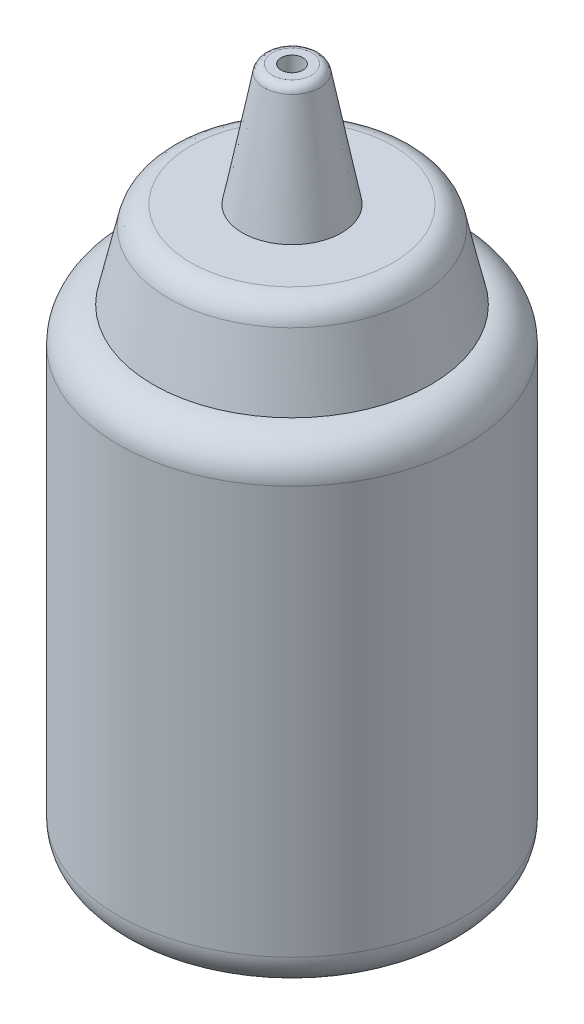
ISO-10303-21;
HEADER;
FILE_DESCRIPTION(('STEP AP214'),'2;1');
FILE_NAME('part.step','',(''),(''),'','','');
FILE_SCHEMA(('AUTOMOTIVE_DESIGN { 1 0 10303 214 1 1 1 1 }'));
ENDSEC;
DATA;
#1=APPLICATION_CONTEXT('core data for automotive mechanical design processes');
#2=APPLICATION_PROTOCOL_DEFINITION('international standard','automotive_design',2000,#1);
#3=PRODUCT_CONTEXT('',#1,'mechanical');
#4=PRODUCT('Part','Part','',(#3));
#5=PRODUCT_RELATED_PRODUCT_CATEGORY('part','',(#4));
#6=PRODUCT_DEFINITION_FORMATION('','',#4);
#7=PRODUCT_DEFINITION_CONTEXT('part definition',#1,'design');
#8=PRODUCT_DEFINITION('design','',#6,#7);
#9=PRODUCT_DEFINITION_SHAPE('','',#8);
#10=(LENGTH_UNIT() NAMED_UNIT(*) SI_UNIT(.MILLI.,.METRE.));
#11=(NAMED_UNIT(*) PLANE_ANGLE_UNIT() SI_UNIT($,.RADIAN.));
#12=(NAMED_UNIT(*) SI_UNIT($,.STERADIAN.) SOLID_ANGLE_UNIT());
#13=UNCERTAINTY_MEASURE_WITH_UNIT(LENGTH_MEASURE(1.E-05),#10,'distance_accuracy_value','');
#14=(GEOMETRIC_REPRESENTATION_CONTEXT(3) GLOBAL_UNCERTAINTY_ASSIGNED_CONTEXT((#13)) GLOBAL_UNIT_ASSIGNED_CONTEXT((#10,
#11,#12)) REPRESENTATION_CONTEXT('',''));
#15=CARTESIAN_POINT('',(0.,0.,0.));
#16=DIRECTION('',(0.,0.,1.));
#17=DIRECTION('',(1.,0.,0.));
#18=AXIS2_PLACEMENT_3D('',#15,#16,#17);
#19=CARTESIAN_POINT('',(-16.0001000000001,55.,0.));
#20=CARTESIAN_POINT('',(-18.2001000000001,55.,0.));
#21=CARTESIAN_POINT('',(-20.,53.2001,0.));
#22=CARTESIAN_POINT('',(-20.,51.0001,0.));
#23=B_SPLINE_CURVE_WITH_KNOTS('',3,(#19,#20,#21,#22),.UNSPECIFIED.,.F.,.F.,(4,4),(0.,
0.0909090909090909),.UNSPECIFIED.);
#24=CARTESIAN_POINT('',(0.,0.,0.));
#25=DIRECTION('',(0.,-1.,0.));
#26=AXIS1_PLACEMENT('',#24,#25);
#27=SURFACE_OF_REVOLUTION('',#23,#26);
#28=CARTESIAN_POINT('',(0.,51.0001,0.));
#29=DIRECTION('',(0.,-1.,0.));
#30=DIRECTION('',(0.,0.,-1.));
#31=AXIS2_PLACEMENT_3D('',#28,#29,#30);
#32=CIRCLE('',#31,20.);
#33=CARTESIAN_POINT('',(0.,51.0001,-20.));
#34=VERTEX_POINT('',#33);
#35=EDGE_CURVE('E79',#34,#34,#32,.T.);
#36=ORIENTED_EDGE('',*,*,#35,.F.);
#37=EDGE_LOOP('',(#36));
#38=FACE_BOUND('',#37,.T.);
#39=CARTESIAN_POINT('',(0.,55.,0.));
#40=DIRECTION('',(0.,-1.,0.));
#41=DIRECTION('',(0.,0.,-1.));
#42=AXIS2_PLACEMENT_3D('',#39,#40,#41);
#43=CIRCLE('',#42,16.0001000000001);
#44=CARTESIAN_POINT('',(0.,55.,-16.0001000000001));
#45=VERTEX_POINT('',#44);
#46=EDGE_CURVE('E10',#45,#45,#43,.T.);
#47=ORIENTED_EDGE('',*,*,#46,.T.);
#48=EDGE_LOOP('',(#47));
#49=FACE_BOUND('',#48,.T.);
#50=ADVANCED_FACE('F39',(#38,#49),#27,.T.);
#51=CARTESIAN_POINT('',(0.,62.7408,0.));
#52=DIRECTION('',(0.,-1.,0.));
#53=DIRECTION('',(0.,0.,-1.));
#54=AXIS2_PLACEMENT_3D('',#51,#52,#53);
#55=CONICAL_SURFACE('',#54,14.2466000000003,0.222767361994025);
#56=ORIENTED_EDGE('',*,*,#46,.F.);
#57=EDGE_LOOP('',(#56));
#58=FACE_BOUND('',#57,.T.);
#59=CARTESIAN_POINT('',(0.,62.7408,0.));
#60=DIRECTION('',(0.,-1.,0.));
#61=DIRECTION('',(0.,0.,-1.));
#62=AXIS2_PLACEMENT_3D('',#59,#60,#61);
#63=CIRCLE('',#62,14.2466000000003);
#64=CARTESIAN_POINT('',(0.,62.7408,-14.2466000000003));
#65=VERTEX_POINT('',#64);
#66=EDGE_CURVE('E47',#65,#65,#63,.T.);
#67=ORIENTED_EDGE('',*,*,#66,.T.);
#68=EDGE_LOOP('',(#67));
#69=FACE_BOUND('',#68,.T.);
#70=ADVANCED_FACE('F100',(#58,#69),#55,.T.);
#71=CARTESIAN_POINT('',(-11.6625000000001,65.,0.));
#72=CARTESIAN_POINT('',(-12.8979000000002,65.,0.));
#73=CARTESIAN_POINT('',(-13.9415000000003,64.0876,0.));
#74=CARTESIAN_POINT('',(-14.2466000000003,62.7408,0.));
#75=B_SPLINE_CURVE_WITH_KNOTS('',3,(#71,#72,#73,#74),.UNSPECIFIED.,.F.,.F.,(4,4),
(0.818181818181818,0.909090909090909),.UNSPECIFIED.);
#76=CARTESIAN_POINT('',(0.,0.,0.));
#77=DIRECTION('',(0.,-1.,0.));
#78=AXIS1_PLACEMENT('',#76,#77);
#79=SURFACE_OF_REVOLUTION('',#75,#78);
#80=ORIENTED_EDGE('',*,*,#66,.F.);
#81=EDGE_LOOP('',(#80));
#82=FACE_BOUND('',#81,.T.);
#83=CARTESIAN_POINT('',(0.,65.,0.));
#84=DIRECTION('',(0.,-1.,0.));
#85=DIRECTION('',(0.,0.,-1.));
#86=AXIS2_PLACEMENT_3D('',#83,#84,#85);
#87=CIRCLE('',#86,11.6625000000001);
#88=CARTESIAN_POINT('',(0.,65.,-11.6625000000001));
#89=VERTEX_POINT('',#88);
#90=EDGE_CURVE('E52',#89,#89,#87,.T.);
#91=ORIENTED_EDGE('',*,*,#90,.T.);
#92=EDGE_LOOP('',(#91));
#93=FACE_BOUND('',#92,.T.);
#94=ADVANCED_FACE('F96',(#82,#93),#79,.T.);
#95=CARTESIAN_POINT('',(-5.71430000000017,65.,0.));
#96=DIRECTION('',(0.,-1.,0.));
#97=DIRECTION('',(0.,0.,-1.));
#98=AXIS2_PLACEMENT_3D('',#95,#96,#97);
#99=PLANE('',#98);
#100=ORIENTED_EDGE('',*,*,#90,.F.);
#101=EDGE_LOOP('',(#100));
#102=FACE_BOUND('',#101,.T.);
#103=CARTESIAN_POINT('',(0.,65.,0.));
#104=DIRECTION('',(0.,-1.,0.));
#105=DIRECTION('',(0.,0.,-1.));
#106=AXIS2_PLACEMENT_3D('',#103,#104,#105);
#107=CIRCLE('',#106,5.71430000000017);
#108=CARTESIAN_POINT('',(0.,65.,-5.71430000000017));
#109=VERTEX_POINT('',#108);
#110=EDGE_CURVE('E57',#109,#109,#107,.T.);
#111=ORIENTED_EDGE('',*,*,#110,.T.);
#112=EDGE_LOOP('',(#111));
#113=FACE_BOUND('',#112,.T.);
#114=ADVANCED_FACE('F99',(#102,#113),#99,.F.);
#115=CARTESIAN_POINT('',(0.,78.1978,0.));
#116=DIRECTION('',(0.,-1.,0.));
#117=DIRECTION('',(0.,0.,-1.));
#118=AXIS2_PLACEMENT_3D('',#115,#116,#117);
#119=CONICAL_SURFACE('',#118,3.17820000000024,0.189846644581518);
#120=ORIENTED_EDGE('',*,*,#110,.F.);
#121=EDGE_LOOP('',(#120));
#122=FACE_BOUND('',#121,.T.);
#123=CARTESIAN_POINT('',(0.,78.1978,0.));
#124=DIRECTION('',(0.,-1.,0.));
#125=DIRECTION('',(0.,0.,-1.));
#126=AXIS2_PLACEMENT_3D('',#123,#124,#125);
#127=CIRCLE('',#126,3.17820000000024);
#128=CARTESIAN_POINT('',(0.,78.1978,-3.17820000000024));
#129=VERTEX_POINT('',#128);
#130=EDGE_CURVE('E63',#129,#129,#127,.T.);
#131=ORIENTED_EDGE('',*,*,#130,.T.);
#132=EDGE_LOOP('',(#131));
#133=FACE_BOUND('',#132,.T.);
#134=ADVANCED_FACE('F164',(#122,#133),#119,.T.);
#135=CARTESIAN_POINT('',(-2.24460000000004,79.,0.));
#136=CARTESIAN_POINT('',(-2.70270000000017,79.,0.));
#137=CARTESIAN_POINT('',(-3.08760000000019,78.6693,0.));
#138=CARTESIAN_POINT('',(-3.17820000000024,78.1978,0.));
#139=B_SPLINE_CURVE_WITH_KNOTS('',3,(#135,#136,#137,#138),.UNSPECIFIED.,.F.,.F.,(4,4),
(0.545454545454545,0.636363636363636),.UNSPECIFIED.);
#140=CARTESIAN_POINT('',(0.,0.,0.));
#141=DIRECTION('',(0.,-1.,0.));
#142=AXIS1_PLACEMENT('',#140,#141);
#143=SURFACE_OF_REVOLUTION('',#139,#142);
#144=ORIENTED_EDGE('',*,*,#130,.F.);
#145=EDGE_LOOP('',(#144));
#146=FACE_BOUND('',#145,.T.);
#147=CARTESIAN_POINT('',(0.,79.,0.));
#148=DIRECTION('',(0.,-1.,0.));
#149=DIRECTION('',(0.,0.,-1.));
#150=AXIS2_PLACEMENT_3D('',#147,#148,#149);
#151=CIRCLE('',#150,2.24460000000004);
#152=CARTESIAN_POINT('',(0.,79.,-2.24460000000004));
#153=VERTEX_POINT('',#152);
#154=EDGE_CURVE('E67',#153,#153,#151,.T.);
#155=ORIENTED_EDGE('',*,*,#154,.T.);
#156=EDGE_LOOP('',(#155));
#157=FACE_BOUND('',#156,.T.);
#158=ADVANCED_FACE('F160',(#146,#157),#143,.T.);
#159=CARTESIAN_POINT('',(0.,79.,0.));
#160=DIRECTION('',(0.,-1.,0.));
#161=DIRECTION('',(0.,0.,-1.));
#162=AXIS2_PLACEMENT_3D('',#159,#160,#161);
#163=PLANE('',#162);
#164=CARTESIAN_POINT('',(0.,79.,0.));
#165=DIRECTION('',(0.,1.,0.));
#166=DIRECTION('',(0.,0.,1.));
#167=AXIS2_PLACEMENT_3D('',#164,#165,#166);
#168=CIRCLE('',#167,1.25);
#169=CARTESIAN_POINT('',(0.,79.,1.25));
#170=VERTEX_POINT('',#169);
#171=EDGE_CURVE('E143',#170,#170,#168,.T.);
#172=ORIENTED_EDGE('',*,*,#171,.F.);
#173=EDGE_LOOP('',(#172));
#174=FACE_BOUND('',#173,.T.);
#175=ORIENTED_EDGE('',*,*,#154,.F.);
#176=EDGE_LOOP('',(#175));
#177=FACE_BOUND('',#176,.T.);
#178=ADVANCED_FACE('F157',(#174,#177),#163,.F.);
#179=CARTESIAN_POINT('',(-16.0001000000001,0.,0.));
#180=DIRECTION('',(0.,1.,0.));
#181=DIRECTION('',(0.,0.,1.));
#182=AXIS2_PLACEMENT_3D('',#179,#180,#181);
#183=PLANE('',#182);
#184=CARTESIAN_POINT('',(0.,0.,0.));
#185=DIRECTION('',(0.,-1.,0.));
#186=DIRECTION('',(0.,0.,-1.));
#187=AXIS2_PLACEMENT_3D('',#184,#185,#186);
#188=CIRCLE('',#187,16.0001000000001);
#189=CARTESIAN_POINT('',(0.,0.,-16.0001000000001));
#190=VERTEX_POINT('',#189);
#191=EDGE_CURVE('E71',#190,#190,#188,.T.);
#192=ORIENTED_EDGE('',*,*,#191,.T.);
#193=EDGE_LOOP('',(#192));
#194=FACE_BOUND('',#193,.T.);
#195=ADVANCED_FACE('F126',(#194),#183,.F.);
#196=CARTESIAN_POINT('',(-20.,3.9999,0.));
#197=CARTESIAN_POINT('',(-20.,1.7999,0.));
#198=CARTESIAN_POINT('',(-18.2001000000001,0.,0.));
#199=CARTESIAN_POINT('',(-16.0001000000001,0.,0.));
#200=B_SPLINE_CURVE_WITH_KNOTS('',3,(#196,#197,#198,#199),.UNSPECIFIED.,.F.,.F.,(4,4),
(0.181818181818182,0.272727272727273),.UNSPECIFIED.);
#201=CARTESIAN_POINT('',(0.,0.,0.));
#202=DIRECTION('',(0.,-1.,0.));
#203=AXIS1_PLACEMENT('',#201,#202);
#204=SURFACE_OF_REVOLUTION('',#200,#203);
#205=ORIENTED_EDGE('',*,*,#191,.F.);
#206=EDGE_LOOP('',(#205));
#207=FACE_BOUND('',#206,.T.);
#208=CARTESIAN_POINT('',(0.,3.9999,0.));
#209=DIRECTION('',(0.,-1.,0.));
#210=DIRECTION('',(0.,0.,-1.));
#211=AXIS2_PLACEMENT_3D('',#208,#209,#210);
#212=CIRCLE('',#211,20.);
#213=CARTESIAN_POINT('',(0.,3.9999,-20.));
#214=VERTEX_POINT('',#213);
#215=EDGE_CURVE('E75',#214,#214,#212,.T.);
#216=ORIENTED_EDGE('',*,*,#215,.T.);
#217=EDGE_LOOP('',(#216));
#218=FACE_BOUND('',#217,.T.);
#219=ADVANCED_FACE('F116',(#207,#218),#204,.T.);
#220=CARTESIAN_POINT('',(0.,0.,0.));
#221=DIRECTION('',(0.,-1.,0.));
#222=DIRECTION('',(0.,0.,-1.));
#223=AXIS2_PLACEMENT_3D('',#220,#221,#222);
#224=CYLINDRICAL_SURFACE('',#223,20.);
#225=ORIENTED_EDGE('',*,*,#215,.F.);
#226=EDGE_LOOP('',(#225));
#227=FACE_BOUND('',#226,.T.);
#228=ORIENTED_EDGE('',*,*,#35,.T.);
#229=EDGE_LOOP('',(#228));
#230=FACE_BOUND('',#229,.T.);
#231=ADVANCED_FACE('F113',(#227,#230),#224,.T.);
#232=CARTESIAN_POINT('',(0.,69.,0.));
#233=DIRECTION('',(0.,1.,0.));
#234=DIRECTION('',(0.,0.,1.));
#235=AXIS2_PLACEMENT_3D('',#232,#233,#234);
#236=CYLINDRICAL_SURFACE('',#235,1.25);
#237=CARTESIAN_POINT('',(0.,69.,0.));
#238=DIRECTION('',(0.,1.,0.));
#239=DIRECTION('',(0.,0.,1.));
#240=AXIS2_PLACEMENT_3D('',#237,#238,#239);
#241=CIRCLE('',#240,1.25);
#242=CARTESIAN_POINT('',(0.,69.,1.25));
#243=VERTEX_POINT('',#242);
#244=EDGE_CURVE('E83',#243,#243,#241,.T.);
#245=ORIENTED_EDGE('',*,*,#244,.F.);
#246=EDGE_LOOP('',(#245));
#247=FACE_BOUND('',#246,.T.);
#248=ORIENTED_EDGE('',*,*,#171,.T.);
#249=EDGE_LOOP('',(#248));
#250=FACE_BOUND('',#249,.T.);
#251=ADVANCED_FACE('F115',(#247,#250),#236,.F.);
#252=CARTESIAN_POINT('',(0.,69.,0.));
#253=DIRECTION('',(0.,1.,0.));
#254=DIRECTION('',(0.,0.,1.));
#255=AXIS2_PLACEMENT_3D('',#252,#253,#254);
#256=PLANE('',#255);
#257=ORIENTED_EDGE('',*,*,#244,.T.);
#258=EDGE_LOOP('',(#257));
#259=FACE_BOUND('',#258,.T.);
#260=ADVANCED_FACE('F123',(#259),#256,.T.);
#261=CLOSED_SHELL('',(#50,#70,#94,#114,#134,#158,#178,#195,#219,#231,#251,#260));
#262=MANIFOLD_SOLID_BREP('B2',#261);
#263=ADVANCED_BREP_SHAPE_REPRESENTATION('',(#18,#262),#14);
#264=SHAPE_DEFINITION_REPRESENTATION(#9,#263);
ENDSEC;
END-ISO-10303-21;
